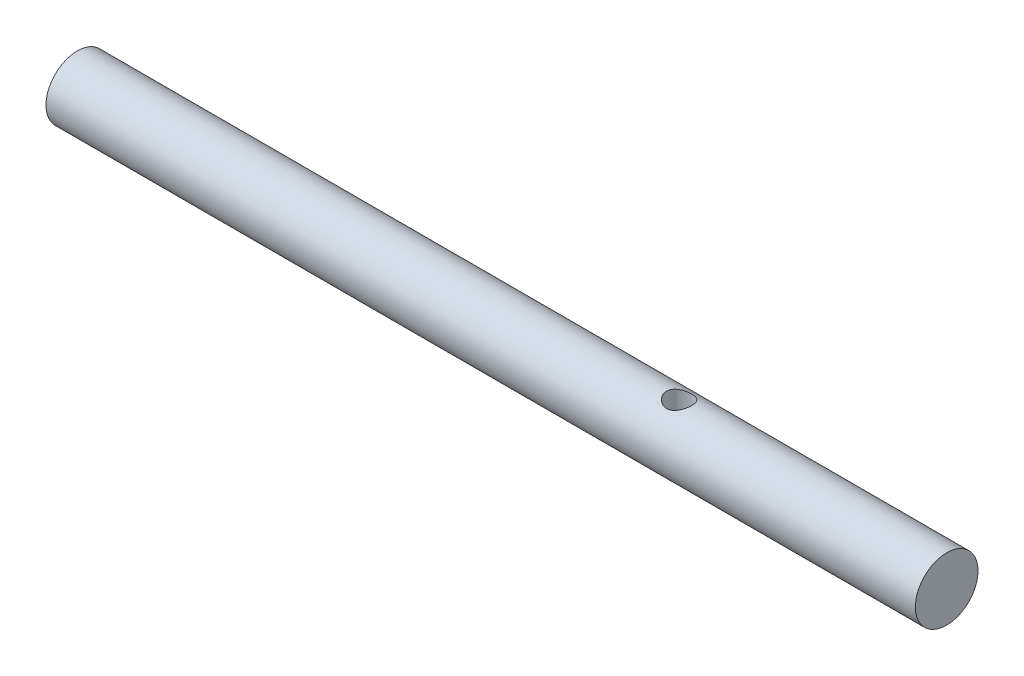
from build123d import *

# Parameters (mm, degrees)
SKETCH2_W          = 660.4
SKETCH2_H          = 47.625
EXTRUDE1_DEPTH     = 47.625
SKETCH3_R          = 9.525
CUT_EXTRUDE1_DEPTH = 47.625
SKETCH4_OUTSIDE_W  = 182.391
SKETCH4_OUTSIDE_H  = 182.391
SKETCH4_OUTSIDE_R  = 23.8125
CUT_EXTRUDE2_DEPTH = 660.4


with BuildPart() as part:
    # Sketch2 → Extrude1 (new body)
    with BuildSketch(Plane.XY):
        with Locations((-330.2, -23.8125)):
            Rectangle(SKETCH2_W, SKETCH2_H)
    extrude(amount=EXTRUDE1_DEPTH)

    # Sketch3 → Cut-Extrude1 (cut)
    with BuildSketch(Plane(origin=(0, 0, 0), x_dir=(1, 0, 0), z_dir=(0, 1, 0))):
        with Locations(Location((-203.2, -23.8125, 0), (0, 0, 180))):
            Circle(SKETCH3_R)
    extrude(amount=-CUT_EXTRUDE1_DEPTH, mode=Mode.SUBTRACT)

    # Sketch4 outside → Cut-Extrude2 (cut)
    with BuildSketch(Plane(origin=(0, 0, 0), x_dir=(0, 0, -1), z_dir=(1, 0, 0))):
        with Locations((-23.8125, -23.8125)):
            Rectangle(SKETCH4_OUTSIDE_W, SKETCH4_OUTSIDE_H)
        with Locations(Location((-23.8125, -23.8125, 0), (0, 0, 90))):
            Circle(SKETCH4_OUTSIDE_R, mode=Mode.SUBTRACT)
    extrude(amount=-CUT_EXTRUDE2_DEPTH, mode=Mode.SUBTRACT)


solid = part.part
